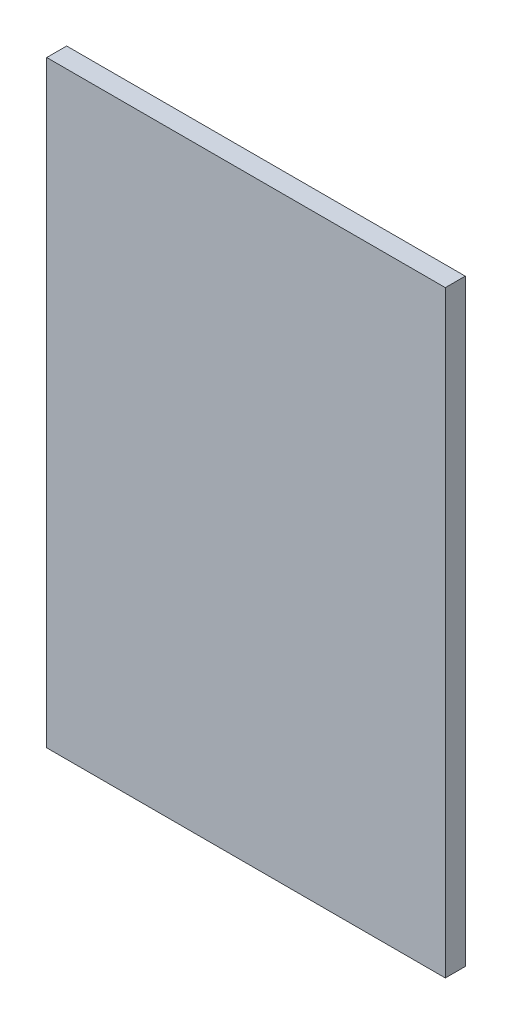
ISO-10303-21;
HEADER;
FILE_DESCRIPTION(('STEP AP214'),'2;1');
FILE_NAME('part.step','',(''),(''),'','','');
FILE_SCHEMA(('AUTOMOTIVE_DESIGN { 1 0 10303 214 1 1 1 1 }'));
ENDSEC;
DATA;
#1=APPLICATION_CONTEXT('core data for automotive mechanical design processes');
#2=APPLICATION_PROTOCOL_DEFINITION('international standard','automotive_design',2000,#1);
#3=PRODUCT_CONTEXT('',#1,'mechanical');
#4=PRODUCT('Part','Part','',(#3));
#5=PRODUCT_RELATED_PRODUCT_CATEGORY('part','',(#4));
#6=PRODUCT_DEFINITION_FORMATION('','',#4);
#7=PRODUCT_DEFINITION_CONTEXT('part definition',#1,'design');
#8=PRODUCT_DEFINITION('design','',#6,#7);
#9=PRODUCT_DEFINITION_SHAPE('','',#8);
#10=(LENGTH_UNIT() NAMED_UNIT(*) SI_UNIT(.MILLI.,.METRE.));
#11=(NAMED_UNIT(*) PLANE_ANGLE_UNIT() SI_UNIT($,.RADIAN.));
#12=(NAMED_UNIT(*) SI_UNIT($,.STERADIAN.) SOLID_ANGLE_UNIT());
#13=UNCERTAINTY_MEASURE_WITH_UNIT(LENGTH_MEASURE(1.E-05),#10,'distance_accuracy_value','');
#14=(GEOMETRIC_REPRESENTATION_CONTEXT(3) GLOBAL_UNCERTAINTY_ASSIGNED_CONTEXT((#13)) GLOBAL_UNIT_ASSIGNED_CONTEXT((#10,
#11,#12)) REPRESENTATION_CONTEXT('',''));
#15=CARTESIAN_POINT('',(0.,0.,0.));
#16=DIRECTION('',(0.,0.,1.));
#17=DIRECTION('',(1.,0.,0.));
#18=AXIS2_PLACEMENT_3D('',#15,#16,#17);
#19=CARTESIAN_POINT('',(0.,0.,5.));
#20=DIRECTION('',(1.,0.,0.));
#21=DIRECTION('',(0.,0.,-1.));
#22=AXIS2_PLACEMENT_3D('',#19,#20,#21);
#23=PLANE('',#22);
#24=DIRECTION('',(0.,-1.,0.));
#25=VECTOR('',#24,1.);
#26=CARTESIAN_POINT('',(0.,0.,0.));
#27=LINE('',#26,#25);
#28=CARTESIAN_POINT('',(0.,150.,0.));
#29=VERTEX_POINT('',#28);
#30=CARTESIAN_POINT('',(0.,0.,0.));
#31=VERTEX_POINT('',#30);
#32=EDGE_CURVE('E95',#29,#31,#27,.T.);
#33=ORIENTED_EDGE('',*,*,#32,.T.);
#34=DIRECTION('',(0.,0.,-1.));
#35=VECTOR('',#34,1.);
#36=CARTESIAN_POINT('',(0.,0.,5.));
#37=LINE('',#36,#35);
#38=CARTESIAN_POINT('',(0.,0.,5.));
#39=VERTEX_POINT('',#38);
#40=EDGE_CURVE('E11',#39,#31,#37,.T.);
#41=ORIENTED_EDGE('',*,*,#40,.F.);
#42=DIRECTION('',(0.,-1.,0.));
#43=VECTOR('',#42,1.);
#44=CARTESIAN_POINT('',(0.,0.,5.));
#45=LINE('',#44,#43);
#46=CARTESIAN_POINT('',(0.,150.,5.));
#47=VERTEX_POINT('',#46);
#48=EDGE_CURVE('E83',#47,#39,#45,.T.);
#49=ORIENTED_EDGE('',*,*,#48,.F.);
#50=DIRECTION('',(0.,0.,-1.));
#51=VECTOR('',#50,1.);
#52=CARTESIAN_POINT('',(0.,150.,5.));
#53=LINE('',#52,#51);
#54=EDGE_CURVE('E91',#47,#29,#53,.T.);
#55=ORIENTED_EDGE('',*,*,#54,.T.);
#56=EDGE_LOOP('',(#33,#41,#49,#55));
#57=FACE_BOUND('',#56,.T.);
#58=ADVANCED_FACE('F32',(#57),#23,.F.);
#59=CARTESIAN_POINT('',(0.,0.,5.));
#60=DIRECTION('',(0.,1.,0.));
#61=DIRECTION('',(0.,0.,1.));
#62=AXIS2_PLACEMENT_3D('',#59,#60,#61);
#63=PLANE('',#62);
#64=DIRECTION('',(1.,0.,0.));
#65=VECTOR('',#64,1.);
#66=CARTESIAN_POINT('',(0.,0.,0.));
#67=LINE('',#66,#65);
#68=CARTESIAN_POINT('',(100.,0.,0.));
#69=VERTEX_POINT('',#68);
#70=EDGE_CURVE('E87',#31,#69,#67,.T.);
#71=ORIENTED_EDGE('',*,*,#70,.T.);
#72=DIRECTION('',(0.,0.,-1.));
#73=VECTOR('',#72,1.);
#74=CARTESIAN_POINT('',(100.,0.,5.));
#75=LINE('',#74,#73);
#76=CARTESIAN_POINT('',(100.,0.,5.));
#77=VERTEX_POINT('',#76);
#78=EDGE_CURVE('E40',#77,#69,#75,.T.);
#79=ORIENTED_EDGE('',*,*,#78,.F.);
#80=DIRECTION('',(1.,0.,0.));
#81=VECTOR('',#80,1.);
#82=CARTESIAN_POINT('',(0.,0.,5.));
#83=LINE('',#82,#81);
#84=EDGE_CURVE('E78',#39,#77,#83,.T.);
#85=ORIENTED_EDGE('',*,*,#84,.F.);
#86=ORIENTED_EDGE('',*,*,#40,.T.);
#87=EDGE_LOOP('',(#71,#79,#85,#86));
#88=FACE_BOUND('',#87,.T.);
#89=ADVANCED_FACE('F86',(#88),#63,.F.);
#90=CARTESIAN_POINT('',(100.,0.,5.));
#91=DIRECTION('',(-1.,0.,0.));
#92=DIRECTION('',(0.,0.,1.));
#93=AXIS2_PLACEMENT_3D('',#90,#91,#92);
#94=PLANE('',#93);
#95=DIRECTION('',(0.,1.,0.));
#96=VECTOR('',#95,1.);
#97=CARTESIAN_POINT('',(100.,0.,0.));
#98=LINE('',#97,#96);
#99=CARTESIAN_POINT('',(100.,150.,0.));
#100=VERTEX_POINT('',#99);
#101=EDGE_CURVE('E65',#69,#100,#98,.T.);
#102=ORIENTED_EDGE('',*,*,#101,.T.);
#103=DIRECTION('',(0.,0.,-1.));
#104=VECTOR('',#103,1.);
#105=CARTESIAN_POINT('',(100.,150.,5.));
#106=LINE('',#105,#104);
#107=CARTESIAN_POINT('',(100.,150.,5.));
#108=VERTEX_POINT('',#107);
#109=EDGE_CURVE('E88',#108,#100,#106,.T.);
#110=ORIENTED_EDGE('',*,*,#109,.F.);
#111=DIRECTION('',(0.,1.,0.));
#112=VECTOR('',#111,1.);
#113=CARTESIAN_POINT('',(100.,0.,5.));
#114=LINE('',#113,#112);
#115=EDGE_CURVE('E81',#77,#108,#114,.T.);
#116=ORIENTED_EDGE('',*,*,#115,.F.);
#117=ORIENTED_EDGE('',*,*,#78,.T.);
#118=EDGE_LOOP('',(#102,#110,#116,#117));
#119=FACE_BOUND('',#118,.T.);
#120=ADVANCED_FACE('F89',(#119),#94,.F.);
#121=CARTESIAN_POINT('',(0.,150.,5.));
#122=DIRECTION('',(0.,-1.,0.));
#123=DIRECTION('',(0.,0.,-1.));
#124=AXIS2_PLACEMENT_3D('',#121,#122,#123);
#125=PLANE('',#124);
#126=DIRECTION('',(-1.,0.,0.));
#127=VECTOR('',#126,1.);
#128=CARTESIAN_POINT('',(0.,150.,0.));
#129=LINE('',#128,#127);
#130=EDGE_CURVE('E71',#100,#29,#129,.T.);
#131=ORIENTED_EDGE('',*,*,#130,.T.);
#132=ORIENTED_EDGE('',*,*,#54,.F.);
#133=DIRECTION('',(-1.,0.,0.));
#134=VECTOR('',#133,1.);
#135=CARTESIAN_POINT('',(0.,150.,5.));
#136=LINE('',#135,#134);
#137=EDGE_CURVE('E48',#108,#47,#136,.T.);
#138=ORIENTED_EDGE('',*,*,#137,.F.);
#139=ORIENTED_EDGE('',*,*,#109,.T.);
#140=EDGE_LOOP('',(#131,#132,#138,#139));
#141=FACE_BOUND('',#140,.T.);
#142=ADVANCED_FACE('F102',(#141),#125,.F.);
#143=CARTESIAN_POINT('',(0.,0.,5.));
#144=DIRECTION('',(0.,0.,-1.));
#145=DIRECTION('',(-1.,0.,0.));
#146=AXIS2_PLACEMENT_3D('',#143,#144,#145);
#147=PLANE('',#146);
#148=ORIENTED_EDGE('',*,*,#48,.T.);
#149=ORIENTED_EDGE('',*,*,#84,.T.);
#150=ORIENTED_EDGE('',*,*,#115,.T.);
#151=ORIENTED_EDGE('',*,*,#137,.T.);
#152=EDGE_LOOP('',(#148,#149,#150,#151));
#153=FACE_BOUND('',#152,.T.);
#154=ADVANCED_FACE('F79',(#153),#147,.F.);
#155=CARTESIAN_POINT('',(0.,0.,0.));
#156=DIRECTION('',(0.,0.,-1.));
#157=DIRECTION('',(-1.,0.,0.));
#158=AXIS2_PLACEMENT_3D('',#155,#156,#157);
#159=PLANE('',#158);
#160=ORIENTED_EDGE('',*,*,#32,.F.);
#161=ORIENTED_EDGE('',*,*,#130,.F.);
#162=ORIENTED_EDGE('',*,*,#101,.F.);
#163=ORIENTED_EDGE('',*,*,#70,.F.);
#164=EDGE_LOOP('',(#160,#161,#162,#163));
#165=FACE_BOUND('',#164,.T.);
#166=ADVANCED_FACE('F105',(#165),#159,.T.);
#167=CLOSED_SHELL('',(#58,#89,#120,#142,#154,#166));
#168=MANIFOLD_SOLID_BREP('B2',#167);
#169=ADVANCED_BREP_SHAPE_REPRESENTATION('',(#18,#168),#14);
#170=SHAPE_DEFINITION_REPRESENTATION(#9,#169);
ENDSEC;
END-ISO-10303-21;
